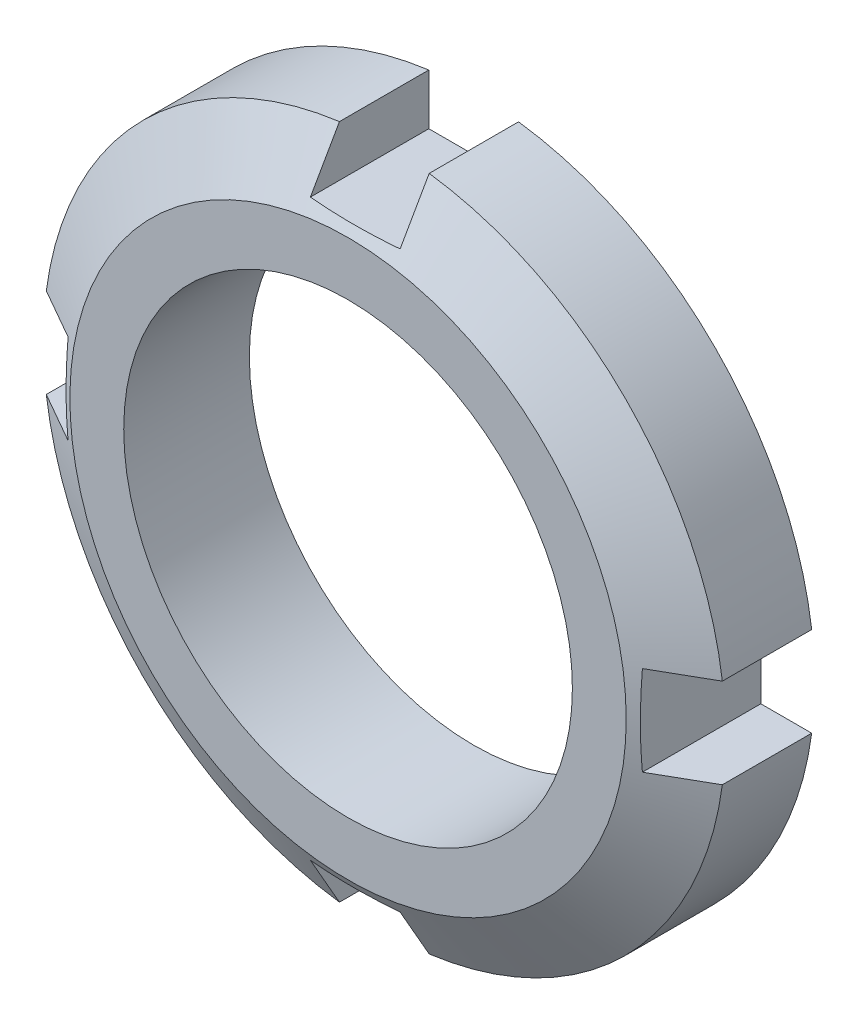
ISO-10303-21;
HEADER;
FILE_DESCRIPTION(('STEP AP214'),'2;1');
FILE_NAME('part.step','',(''),(''),'','','');
FILE_SCHEMA(('AUTOMOTIVE_DESIGN { 1 0 10303 214 1 1 1 1 }'));
ENDSEC;
DATA;
#1=APPLICATION_CONTEXT('core data for automotive mechanical design processes');
#2=APPLICATION_PROTOCOL_DEFINITION('international standard','automotive_design',2000,#1);
#3=PRODUCT_CONTEXT('',#1,'mechanical');
#4=PRODUCT('Part','Part','',(#3));
#5=PRODUCT_RELATED_PRODUCT_CATEGORY('part','',(#4));
#6=PRODUCT_DEFINITION_FORMATION('','',#4);
#7=PRODUCT_DEFINITION_CONTEXT('part definition',#1,'design');
#8=PRODUCT_DEFINITION('design','',#6,#7);
#9=PRODUCT_DEFINITION_SHAPE('','',#8);
#10=(LENGTH_UNIT() NAMED_UNIT(*) SI_UNIT(.MILLI.,.METRE.));
#11=(NAMED_UNIT(*) PLANE_ANGLE_UNIT() SI_UNIT($,.RADIAN.));
#12=(NAMED_UNIT(*) SI_UNIT($,.STERADIAN.) SOLID_ANGLE_UNIT());
#13=UNCERTAINTY_MEASURE_WITH_UNIT(LENGTH_MEASURE(1.E-05),#10,'distance_accuracy_value','');
#14=(GEOMETRIC_REPRESENTATION_CONTEXT(3) GLOBAL_UNCERTAINTY_ASSIGNED_CONTEXT((#13)) GLOBAL_UNIT_ASSIGNED_CONTEXT((#10,
#11,#12)) REPRESENTATION_CONTEXT('',''));
#15=CARTESIAN_POINT('',(0.,0.,0.));
#16=DIRECTION('',(0.,0.,1.));
#17=DIRECTION('',(1.,0.,0.));
#18=AXIS2_PLACEMENT_3D('',#15,#16,#17);
#19=CARTESIAN_POINT('',(0.,0.,7.));
#20=DIRECTION('',(0.,0.,-1.));
#21=DIRECTION('',(-1.,0.,0.));
#22=AXIS2_PLACEMENT_3D('',#19,#20,#21);
#23=CYLINDRICAL_SURFACE('',#22,19.);
#24=CARTESIAN_POINT('',(0.,0.,4.97927405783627));
#25=DIRECTION('',(0.,0.,1.));
#26=DIRECTION('',(1.,0.,0.));
#27=AXIS2_PLACEMENT_3D('',#24,#25,#26);
#28=CIRCLE('',#27,19.);
#29=CARTESIAN_POINT('',(2.5,18.8348082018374,4.97927405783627));
#30=VERTEX_POINT('',#29);
#31=CARTESIAN_POINT('',(18.8348082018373,2.5000000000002,4.97927405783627));
#32=VERTEX_POINT('',#31);
#33=EDGE_CURVE('E247',#30,#32,#28,.F.);
#34=ORIENTED_EDGE('',*,*,#33,.T.);
#35=DIRECTION('',(0.,0.,-1.));
#36=VECTOR('',#35,1.);
#37=CARTESIAN_POINT('',(18.8348082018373,2.50000000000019,7.));
#38=LINE('',#37,#36);
#39=CARTESIAN_POINT('',(18.8348082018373,2.5000000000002,0.));
#40=VERTEX_POINT('',#39);
#41=EDGE_CURVE('E176',#32,#40,#38,.T.);
#42=ORIENTED_EDGE('',*,*,#41,.T.);
#43=CARTESIAN_POINT('',(0.,0.,0.));
#44=DIRECTION('',(0.,0.,1.));
#45=DIRECTION('',(1.,0.,0.));
#46=AXIS2_PLACEMENT_3D('',#43,#44,#45);
#47=CIRCLE('',#46,19.);
#48=CARTESIAN_POINT('',(2.5,18.8348082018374,0.));
#49=VERTEX_POINT('',#48);
#50=EDGE_CURVE('E168',#40,#49,#47,.T.);
#51=ORIENTED_EDGE('',*,*,#50,.T.);
#52=DIRECTION('',(0.,0.,-1.));
#53=VECTOR('',#52,1.);
#54=CARTESIAN_POINT('',(2.5,18.8348082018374,7.));
#55=LINE('',#54,#53);
#56=EDGE_CURVE('E226',#49,#30,#55,.F.);
#57=ORIENTED_EDGE('',*,*,#56,.T.);
#58=EDGE_LOOP('',(#34,#42,#51,#57));
#59=FACE_BOUND('',#58,.T.);
#60=ADVANCED_FACE('F32',(#59),#23,.T.);
#61=CARTESIAN_POINT('',(2.50000000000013,-18.8348082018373,0.));
#62=VERTEX_POINT('',#61);
#63=CARTESIAN_POINT('',(18.8348082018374,-2.49999999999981,0.));
#64=VERTEX_POINT('',#63);
#65=EDGE_CURVE('E405',#62,#64,#47,.T.);
#66=ORIENTED_EDGE('',*,*,#65,.T.);
#67=DIRECTION('',(0.,0.,-1.));
#68=VECTOR('',#67,1.);
#69=CARTESIAN_POINT('',(18.8348082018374,-2.49999999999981,7.));
#70=LINE('',#69,#68);
#71=CARTESIAN_POINT('',(18.8348082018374,-2.49999999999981,4.97927405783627));
#72=VERTEX_POINT('',#71);
#73=EDGE_CURVE('E172',#64,#72,#70,.F.);
#74=ORIENTED_EDGE('',*,*,#73,.T.);
#75=CARTESIAN_POINT('',(2.50000000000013,-18.8348082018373,4.97927405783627));
#76=VERTEX_POINT('',#75);
#77=EDGE_CURVE('E251',#72,#76,#28,.F.);
#78=ORIENTED_EDGE('',*,*,#77,.T.);
#79=DIRECTION('',(0.,0.,-1.));
#80=VECTOR('',#79,1.);
#81=CARTESIAN_POINT('',(2.50000000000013,-18.8348082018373,7.));
#82=LINE('',#81,#80);
#83=EDGE_CURVE('E193',#76,#62,#82,.T.);
#84=ORIENTED_EDGE('',*,*,#83,.T.);
#85=EDGE_LOOP('',(#66,#74,#78,#84));
#86=FACE_BOUND('',#85,.T.);
#87=ADVANCED_FACE('F362',(#86),#23,.T.);
#88=CARTESIAN_POINT('',(-18.8348082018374,-2.50000000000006,0.));
#89=VERTEX_POINT('',#88);
#90=CARTESIAN_POINT('',(-2.49999999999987,-18.8348082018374,0.));
#91=VERTEX_POINT('',#90);
#92=EDGE_CURVE('E243',#89,#91,#47,.T.);
#93=ORIENTED_EDGE('',*,*,#92,.T.);
#94=DIRECTION('',(0.,0.,-1.));
#95=VECTOR('',#94,1.);
#96=CARTESIAN_POINT('',(-2.49999999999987,-18.8348082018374,7.));
#97=LINE('',#96,#95);
#98=CARTESIAN_POINT('',(-2.49999999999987,-18.8348082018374,4.97927405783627));
#99=VERTEX_POINT('',#98);
#100=EDGE_CURVE('E189',#91,#99,#97,.F.);
#101=ORIENTED_EDGE('',*,*,#100,.T.);
#102=CARTESIAN_POINT('',(-18.8348082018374,-2.50000000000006,4.97927405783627));
#103=VERTEX_POINT('',#102);
#104=EDGE_CURVE('E390',#99,#103,#28,.F.);
#105=ORIENTED_EDGE('',*,*,#104,.T.);
#106=DIRECTION('',(0.,0.,-1.));
#107=VECTOR('',#106,1.);
#108=CARTESIAN_POINT('',(-18.8348082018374,-2.50000000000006,7.));
#109=LINE('',#108,#107);
#110=EDGE_CURVE('E212',#103,#89,#109,.T.);
#111=ORIENTED_EDGE('',*,*,#110,.T.);
#112=EDGE_LOOP('',(#93,#101,#105,#111));
#113=FACE_BOUND('',#112,.T.);
#114=ADVANCED_FACE('F367',(#113),#23,.T.);
#115=CARTESIAN_POINT('',(-2.5,18.8348082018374,0.));
#116=VERTEX_POINT('',#115);
#117=CARTESIAN_POINT('',(-18.8348082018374,2.49999999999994,0.));
#118=VERTEX_POINT('',#117);
#119=EDGE_CURVE('E239',#116,#118,#47,.T.);
#120=ORIENTED_EDGE('',*,*,#119,.T.);
#121=DIRECTION('',(0.,0.,-1.));
#122=VECTOR('',#121,1.);
#123=CARTESIAN_POINT('',(-18.8348082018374,2.49999999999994,7.));
#124=LINE('',#123,#122);
#125=CARTESIAN_POINT('',(-18.8348082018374,2.49999999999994,4.97927405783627));
#126=VERTEX_POINT('',#125);
#127=EDGE_CURVE('E208',#118,#126,#124,.F.);
#128=ORIENTED_EDGE('',*,*,#127,.T.);
#129=CARTESIAN_POINT('',(-2.5,18.8348082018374,4.97927405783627));
#130=VERTEX_POINT('',#129);
#131=EDGE_CURVE('E246',#126,#130,#28,.F.);
#132=ORIENTED_EDGE('',*,*,#131,.T.);
#133=DIRECTION('',(0.,0.,-1.));
#134=VECTOR('',#133,1.);
#135=CARTESIAN_POINT('',(-2.5,18.8348082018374,7.));
#136=LINE('',#135,#134);
#137=EDGE_CURVE('E230',#130,#116,#136,.T.);
#138=ORIENTED_EDGE('',*,*,#137,.T.);
#139=EDGE_LOOP('',(#120,#128,#132,#138));
#140=FACE_BOUND('',#139,.T.);
#141=ADVANCED_FACE('F34',(#140),#23,.T.);
#142=CARTESIAN_POINT('',(0.,0.,7.));
#143=DIRECTION('',(0.,0.,1.));
#144=DIRECTION('',(1.,0.,0.));
#145=AXIS2_PLACEMENT_3D('',#142,#143,#144);
#146=PLANE('',#145);
#147=CARTESIAN_POINT('',(0.,0.,7.));
#148=DIRECTION('',(0.,0.,1.));
#149=DIRECTION('',(1.,0.,0.));
#150=AXIS2_PLACEMENT_3D('',#147,#148,#149);
#151=CIRCLE('',#150,15.5);
#152=CARTESIAN_POINT('',(15.5,0.,7.));
#153=VERTEX_POINT('',#152);
#154=EDGE_CURVE('E242',#153,#153,#151,.T.);
#155=ORIENTED_EDGE('',*,*,#154,.T.);
#156=EDGE_LOOP('',(#155));
#157=FACE_BOUND('',#156,.T.);
#158=CARTESIAN_POINT('',(0.,0.,7.));
#159=DIRECTION('',(0.,0.,1.));
#160=DIRECTION('',(1.,0.,0.));
#161=AXIS2_PLACEMENT_3D('',#158,#159,#160);
#162=CIRCLE('',#161,12.5);
#163=CARTESIAN_POINT('',(12.5,0.,7.));
#164=VERTEX_POINT('',#163);
#165=EDGE_CURVE('E233',#164,#164,#162,.T.);
#166=ORIENTED_EDGE('',*,*,#165,.F.);
#167=EDGE_LOOP('',(#166));
#168=FACE_BOUND('',#167,.T.);
#169=ADVANCED_FACE('F370',(#157,#168),#146,.T.);
#170=CARTESIAN_POINT('',(0.,0.,0.));
#171=DIRECTION('',(0.,0.,1.));
#172=DIRECTION('',(1.,0.,0.));
#173=AXIS2_PLACEMENT_3D('',#170,#171,#172);
#174=PLANE('',#173);
#175=ORIENTED_EDGE('',*,*,#50,.F.);
#176=DIRECTION('',(-1.,0.,0.));
#177=VECTOR('',#176,1.);
#178=CARTESIAN_POINT('',(19.,2.5000000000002,0.));
#179=LINE('',#178,#177);
#180=CARTESIAN_POINT('',(16.,2.50000000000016,0.));
#181=VERTEX_POINT('',#180);
#182=EDGE_CURVE('E156',#40,#181,#179,.T.);
#183=ORIENTED_EDGE('',*,*,#182,.T.);
#184=DIRECTION('',(0.,1.,0.));
#185=VECTOR('',#184,1.);
#186=CARTESIAN_POINT('',(16.,-2.49999999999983,0.));
#187=LINE('',#186,#185);
#188=CARTESIAN_POINT('',(16.,-2.49999999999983,0.));
#189=VERTEX_POINT('',#188);
#190=EDGE_CURVE('E147',#189,#181,#187,.T.);
#191=ORIENTED_EDGE('',*,*,#190,.F.);
#192=DIRECTION('',(1.,0.,0.));
#193=VECTOR('',#192,1.);
#194=CARTESIAN_POINT('',(16.,-2.49999999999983,0.));
#195=LINE('',#194,#193);
#196=EDGE_CURVE('E155',#189,#64,#195,.T.);
#197=ORIENTED_EDGE('',*,*,#196,.T.);
#198=ORIENTED_EDGE('',*,*,#65,.F.);
#199=DIRECTION('',(0.,1.,0.));
#200=VECTOR('',#199,1.);
#201=CARTESIAN_POINT('',(2.50000000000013,-19.,0.));
#202=LINE('',#201,#200);
#203=CARTESIAN_POINT('',(2.50000000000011,-16.,0.));
#204=VERTEX_POINT('',#203);
#205=EDGE_CURVE('E178',#62,#204,#202,.T.);
#206=ORIENTED_EDGE('',*,*,#205,.T.);
#207=DIRECTION('',(1.,0.,0.));
#208=VECTOR('',#207,1.);
#209=CARTESIAN_POINT('',(-2.49999999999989,-16.,0.));
#210=LINE('',#209,#208);
#211=CARTESIAN_POINT('',(-2.49999999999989,-16.,0.));
#212=VERTEX_POINT('',#211);
#213=EDGE_CURVE('E181',#212,#204,#210,.T.);
#214=ORIENTED_EDGE('',*,*,#213,.F.);
#215=DIRECTION('',(0.,-1.,0.));
#216=VECTOR('',#215,1.);
#217=CARTESIAN_POINT('',(-2.49999999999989,-16.,0.));
#218=LINE('',#217,#216);
#219=EDGE_CURVE('E183',#212,#91,#218,.T.);
#220=ORIENTED_EDGE('',*,*,#219,.T.);
#221=ORIENTED_EDGE('',*,*,#92,.F.);
#222=DIRECTION('',(1.,0.,0.));
#223=VECTOR('',#222,1.);
#224=CARTESIAN_POINT('',(-19.,-2.50000000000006,0.));
#225=LINE('',#224,#223);
#226=CARTESIAN_POINT('',(-16.,-2.50000000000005,0.));
#227=VERTEX_POINT('',#226);
#228=EDGE_CURVE('E196',#89,#227,#225,.T.);
#229=ORIENTED_EDGE('',*,*,#228,.T.);
#230=DIRECTION('',(0.,-1.,0.));
#231=VECTOR('',#230,1.);
#232=CARTESIAN_POINT('',(-16.,2.49999999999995,0.));
#233=LINE('',#232,#231);
#234=CARTESIAN_POINT('',(-16.,2.49999999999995,0.));
#235=VERTEX_POINT('',#234);
#236=EDGE_CURVE('E199',#235,#227,#233,.T.);
#237=ORIENTED_EDGE('',*,*,#236,.F.);
#238=DIRECTION('',(-1.,0.,0.));
#239=VECTOR('',#238,1.);
#240=CARTESIAN_POINT('',(-16.,2.49999999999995,0.));
#241=LINE('',#240,#239);
#242=EDGE_CURVE('E201',#235,#118,#241,.T.);
#243=ORIENTED_EDGE('',*,*,#242,.T.);
#244=ORIENTED_EDGE('',*,*,#119,.F.);
#245=DIRECTION('',(0.,-1.,0.));
#246=VECTOR('',#245,1.);
#247=CARTESIAN_POINT('',(-2.5,19.,0.));
#248=LINE('',#247,#246);
#249=CARTESIAN_POINT('',(-2.5,16.,0.));
#250=VERTEX_POINT('',#249);
#251=EDGE_CURVE('E215',#116,#250,#248,.T.);
#252=ORIENTED_EDGE('',*,*,#251,.T.);
#253=DIRECTION('',(-1.,0.,0.));
#254=VECTOR('',#253,1.);
#255=CARTESIAN_POINT('',(2.5,16.,0.));
#256=LINE('',#255,#254);
#257=CARTESIAN_POINT('',(2.5,16.,0.));
#258=VERTEX_POINT('',#257);
#259=EDGE_CURVE('E218',#258,#250,#256,.T.);
#260=ORIENTED_EDGE('',*,*,#259,.F.);
#261=DIRECTION('',(0.,1.,0.));
#262=VECTOR('',#261,1.);
#263=CARTESIAN_POINT('',(2.5,16.,0.));
#264=LINE('',#263,#262);
#265=EDGE_CURVE('E220',#258,#49,#264,.T.);
#266=ORIENTED_EDGE('',*,*,#265,.T.);
#267=EDGE_LOOP('',(#175,#183,#191,#197,#198,#206,#214,#220,#221,#229,#237,#243,#244,#252,#260,#266));
#268=FACE_BOUND('',#267,.T.);
#269=CARTESIAN_POINT('',(0.,0.,0.));
#270=DIRECTION('',(0.,0.,1.));
#271=DIRECTION('',(1.,0.,0.));
#272=AXIS2_PLACEMENT_3D('',#269,#270,#271);
#273=CIRCLE('',#272,12.5);
#274=CARTESIAN_POINT('',(12.5,0.,0.));
#275=VERTEX_POINT('',#274);
#276=EDGE_CURVE('E236',#275,#275,#273,.T.);
#277=ORIENTED_EDGE('',*,*,#276,.T.);
#278=EDGE_LOOP('',(#277));
#279=FACE_BOUND('',#278,.T.);
#280=ADVANCED_FACE('F165',(#268,#279),#174,.F.);
#281=CARTESIAN_POINT('',(0.,0.,0.));
#282=DIRECTION('',(0.,0.,1.));
#283=DIRECTION('',(1.,0.,0.));
#284=AXIS2_PLACEMENT_3D('',#281,#282,#283);
#285=CYLINDRICAL_SURFACE('',#284,12.5);
#286=ORIENTED_EDGE('',*,*,#276,.F.);
#287=EDGE_LOOP('',(#286));
#288=FACE_BOUND('',#287,.T.);
#289=ORIENTED_EDGE('',*,*,#165,.T.);
#290=EDGE_LOOP('',(#289));
#291=FACE_BOUND('',#290,.T.);
#292=ADVANCED_FACE('F505',(#288,#291),#285,.F.);
#293=CARTESIAN_POINT('',(0.,0.,7.));
#294=DIRECTION('',(0.,0.,-1.));
#295=DIRECTION('',(-1.,0.,0.));
#296=AXIS2_PLACEMENT_3D('',#293,#294,#295);
#297=CONICAL_SURFACE('',#296,15.5,1.04719755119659);
#298=CARTESIAN_POINT('',(23.3838289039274,2.50000000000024,2.37133176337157));
#299=CARTESIAN_POINT('',(22.8794651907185,2.50000000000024,2.66087538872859));
#300=CARTESIAN_POINT('',(22.3750567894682,2.50000000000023,2.95034113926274));
#301=CARTESIAN_POINT('',(21.3661278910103,2.50000000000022,3.52907746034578));
#302=CARTESIAN_POINT('',(20.861607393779,2.50000000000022,3.81834803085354));
#303=CARTESIAN_POINT('',(19.3478472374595,2.5000000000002,4.68580578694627));
#304=CARTESIAN_POINT('',(18.3384056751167,2.50000000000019,5.26364087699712));
#305=CARTESIAN_POINT('',(16.8235900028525,2.50000000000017,6.12925402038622));
#306=CARTESIAN_POINT('',(16.3185417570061,2.50000000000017,6.41760227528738));
#307=CARTESIAN_POINT('',(15.3081565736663,2.50000000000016,6.99379212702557));
#308=CARTESIAN_POINT('',(14.8028196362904,2.50000000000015,7.28163372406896));
#309=CARTESIAN_POINT('',(13.7917632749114,2.50000000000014,7.85664853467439));
#310=CARTESIAN_POINT('',(13.2860438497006,2.50000000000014,8.14382174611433));
#311=CARTESIAN_POINT('',(12.2740588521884,2.50000000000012,8.71720570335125));
#312=CARTESIAN_POINT('',(11.7677932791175,2.50000000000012,9.00341644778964));
#313=CARTESIAN_POINT('',(11.2611727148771,2.50000000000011,9.28899896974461));
#314=B_SPLINE_CURVE_WITH_KNOTS('',3,(#298,#299,#300,#301,#302,#303,#304,#305,#306,#307,#308,
#309,#310,#311,#312,#313),.UNSPECIFIED.,.F.,.F.,(4,2,2,2,2,2,2,4),(0.,1.74469602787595,
3.489392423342,6.97877401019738,8.72347032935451,10.4681659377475,12.2128670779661,
13.9575706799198),.UNSPECIFIED.);
#315=CARTESIAN_POINT('',(16.,2.50000000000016,6.59924112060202));
#316=VERTEX_POINT('',#315);
#317=EDGE_CURVE('E11',#32,#316,#314,.T.);
#318=ORIENTED_EDGE('',*,*,#317,.F.);
#319=ORIENTED_EDGE('',*,*,#33,.F.);
#320=CARTESIAN_POINT('',(2.5,11.2611727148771,9.28899896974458));
#321=CARTESIAN_POINT('',(2.5,11.7677932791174,9.00341644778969));
#322=CARTESIAN_POINT('',(2.5,12.2740588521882,8.71720570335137));
#323=CARTESIAN_POINT('',(2.5,13.2860438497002,8.14382174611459));
#324=CARTESIAN_POINT('',(2.5,13.7917632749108,7.85664853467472));
#325=CARTESIAN_POINT('',(2.5,14.8028196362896,7.28163372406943));
#326=CARTESIAN_POINT('',(2.5,15.3081565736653,6.99379212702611));
#327=CARTESIAN_POINT('',(2.5,16.318541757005,6.41760227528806));
#328=CARTESIAN_POINT('',(2.5,16.8235900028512,6.12925402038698));
#329=CARTESIAN_POINT('',(2.5,18.3384056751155,5.26364087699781));
#330=CARTESIAN_POINT('',(2.5,19.3478472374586,4.68580578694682));
#331=CARTESIAN_POINT('',(2.5,20.8616073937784,3.81834803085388));
#332=CARTESIAN_POINT('',(2.5,21.3661278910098,3.52907746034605));
#333=CARTESIAN_POINT('',(2.5,22.375056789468,2.95034113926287));
#334=CARTESIAN_POINT('',(2.5,22.8794651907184,2.66087538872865));
#335=CARTESIAN_POINT('',(2.5,23.3838289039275,2.37133176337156));
#336=B_SPLINE_CURVE_WITH_KNOTS('',3,(#320,#321,#322,#323,#324,#325,#326,#327,#328,#329,#330,
#331,#332,#333,#334,#335),.UNSPECIFIED.,.F.,.F.,(4,2,2,2,2,2,2,4),(0.,1.74470360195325,
3.48940474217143,5.23410035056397,6.97879666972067,10.4681782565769,12.2128746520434,
13.9575706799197),.UNSPECIFIED.);
#337=CARTESIAN_POINT('',(2.5,16.,6.59924112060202));
#338=VERTEX_POINT('',#337);
#339=EDGE_CURVE('E258',#338,#30,#336,.T.);
#340=ORIENTED_EDGE('',*,*,#339,.F.);
#341=CARTESIAN_POINT('',(6.81810215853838,16.,5.90757273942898));
#342=CARTESIAN_POINT('',(6.45840968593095,16.,5.98899370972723));
#343=CARTESIAN_POINT('',(6.09750734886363,16.,6.06521717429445));
#344=CARTESIAN_POINT('',(5.37340801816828,16.,6.20628219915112));
#345=CARTESIAN_POINT('',(5.01021053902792,16.,6.27112126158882));
#346=CARTESIAN_POINT('',(4.28143097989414,16.,6.38845405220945));
#347=CARTESIAN_POINT('',(3.91584683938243,16.,6.44093507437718));
#348=CARTESIAN_POINT('',(3.18302879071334,16.,6.5325647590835));
#349=CARTESIAN_POINT('',(2.81579499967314,16.,6.57171435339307));
#350=CARTESIAN_POINT('',(2.08770543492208,16.,6.63528829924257));
#351=CARTESIAN_POINT('',(1.72687492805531,16.,6.66000059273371));
#352=CARTESIAN_POINT('',(1.00452181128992,16.,6.6954691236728));
#353=CARTESIAN_POINT('',(0.642999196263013,16.,6.70622525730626));
#354=CARTESIAN_POINT('',(-0.0799248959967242,16.,6.71356453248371));
#355=CARTESIAN_POINT('',(-0.441326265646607,16.,6.71015813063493));
#356=CARTESIAN_POINT('',(-1.16372288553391,16.,6.68926620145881));
#357=CARTESIAN_POINT('',(-1.52471812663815,16.,6.67178036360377));
#358=CARTESIAN_POINT('',(-2.33620167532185,16.,6.61695222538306));
#359=CARTESIAN_POINT('',(-2.78643105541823,16.,6.57573016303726));
#360=CARTESIAN_POINT('',(-3.6845648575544,16.,6.47295677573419));
#361=CARTESIAN_POINT('',(-4.13246912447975,16.,6.4114041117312));
#362=CARTESIAN_POINT('',(-5.02595060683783,16.,6.2694769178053));
#363=CARTESIAN_POINT('',(-5.47152334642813,16.,6.18907440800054));
#364=CARTESIAN_POINT('',(-6.35928544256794,16.,6.01133878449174));
#365=CARTESIAN_POINT('',(-6.80147457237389,16.,5.9140045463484));
#366=CARTESIAN_POINT('',(-7.69434638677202,16.,5.70144186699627));
#367=CARTESIAN_POINT('',(-8.14492904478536,16.,5.58579558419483));
#368=CARTESIAN_POINT('',(-9.04232668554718,16.,5.34063966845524));
#369=CARTESIAN_POINT('',(-9.48914135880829,16.,5.21112890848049));
#370=CARTESIAN_POINT('',(-10.3774651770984,16.,4.94060292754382));
#371=CARTESIAN_POINT('',(-10.8189877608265,16.,4.79963158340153));
#372=CARTESIAN_POINT('',(-11.6984784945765,16.,4.50740055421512));
#373=CARTESIAN_POINT('',(-12.136447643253,16.,4.35614388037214));
#374=CARTESIAN_POINT('',(-12.57281585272,16.,4.2005151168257));
#375=B_SPLINE_CURVE_WITH_KNOTS('',3,(#341,#342,#343,#344,#345,#346,#347,#348,#349,#350,#351,
#352,#353,#354,#355,#356,#357,#358,#359,#360,#361,#362,#363,#364,#365,#366,#367,#368,#369,#370,
#371,#372,#373,#374),.UNSPECIFIED.,.F.,.F.,(4,2,2,2,2,2,2,2,2,2,2,2,2,2,2,2,4),(0.,
1.10638798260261,2.21301841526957,3.32078171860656,4.42846758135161,5.51323240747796,
6.59800530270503,7.68197742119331,8.76597344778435,10.121799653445,11.4777151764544,
12.8356562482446,14.1936875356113,15.588995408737,16.9844167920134,18.3747269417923,
19.7646317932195),.UNSPECIFIED.);
#376=CARTESIAN_POINT('',(-2.5,16.,6.59924112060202));
#377=VERTEX_POINT('',#376);
#378=EDGE_CURVE('E250',#338,#377,#375,.T.);
#379=ORIENTED_EDGE('',*,*,#378,.T.);
#380=CARTESIAN_POINT('',(-2.5,23.3838289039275,2.37133176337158));
#381=CARTESIAN_POINT('',(-2.5,22.8794651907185,2.6608753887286));
#382=CARTESIAN_POINT('',(-2.5,22.3750567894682,2.95034113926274));
#383=CARTESIAN_POINT('',(-2.5,21.3661278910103,3.52907746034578));
#384=CARTESIAN_POINT('',(-2.5,20.861607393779,3.81834803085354));
#385=CARTESIAN_POINT('',(-2.5,19.3478472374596,4.68580578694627));
#386=CARTESIAN_POINT('',(-2.5,18.3384056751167,5.26364087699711));
#387=CARTESIAN_POINT('',(-2.5,16.8235900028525,6.12925402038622));
#388=CARTESIAN_POINT('',(-2.5,16.3185417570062,6.41760227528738));
#389=CARTESIAN_POINT('',(-2.5,15.3081565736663,6.99379212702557));
#390=CARTESIAN_POINT('',(-2.5,14.8028196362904,7.28163372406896));
#391=CARTESIAN_POINT('',(-2.5,13.7917632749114,7.85664853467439));
#392=CARTESIAN_POINT('',(-2.5,13.2860438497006,8.14382174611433));
#393=CARTESIAN_POINT('',(-2.5,12.2740588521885,8.71720570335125));
#394=CARTESIAN_POINT('',(-2.5,11.7677932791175,9.00341644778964));
#395=CARTESIAN_POINT('',(-2.5,11.2611727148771,9.2889989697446));
#396=B_SPLINE_CURVE_WITH_KNOTS('',3,(#380,#381,#382,#383,#384,#385,#386,#387,#388,#389,#390,
#391,#392,#393,#394,#395),.UNSPECIFIED.,.F.,.F.,(4,2,2,2,2,2,2,4),(0.,1.74469602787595,
3.489392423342,6.97877401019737,8.7234703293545,10.4681659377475,12.2128670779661,
13.9575706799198),.UNSPECIFIED.);
#397=EDGE_CURVE('E280',#130,#377,#396,.T.);
#398=ORIENTED_EDGE('',*,*,#397,.F.);
#399=ORIENTED_EDGE('',*,*,#131,.F.);
#400=CARTESIAN_POINT('',(-12.3950159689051,2.49999999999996,8.64855427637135));
#401=CARTESIAN_POINT('',(-12.901136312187,2.49999999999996,8.3620894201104));
#402=CARTESIAN_POINT('',(-13.406983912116,2.49999999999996,8.07514354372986));
#403=CARTESIAN_POINT('',(-14.4182530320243,2.49999999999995,7.50050282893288));
#404=CARTESIAN_POINT('',(-14.9236745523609,2.49999999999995,7.21280799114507));
#405=CARTESIAN_POINT('',(-15.9342107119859,2.49999999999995,6.63688255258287));
#406=CARTESIAN_POINT('',(-16.4393253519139,2.49999999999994,6.34865195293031));
#407=CARTESIAN_POINT('',(-17.4493183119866,2.49999999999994,5.77177675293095));
#408=CARTESIAN_POINT('',(-17.954196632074,2.49999999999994,5.48313215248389));
#409=CARTESIAN_POINT('',(-19.468560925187,2.49999999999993,4.6167300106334));
#410=CARTESIAN_POINT('',(-20.4777782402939,2.49999999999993,4.03850298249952));
#411=CARTESIAN_POINT('',(-22.4957358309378,2.49999999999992,2.88121217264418));
#412=CARTESIAN_POINT('',(-23.5044761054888,2.49999999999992,2.30214838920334));
#413=CARTESIAN_POINT('',(-24.5130954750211,2.49999999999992,1.72287502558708));
#414=B_SPLINE_CURVE_WITH_KNOTS('',3,(#400,#401,#402,#403,#404,#405,#406,#407,#408,#409,#410,
#411,#412,#413),.UNSPECIFIED.,.F.,.F.,(4,2,2,2,2,2,4),(0.,1.74469946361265,3.48939746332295,
5.23409181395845,6.97878658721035,10.4681691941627,13.9575589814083),.UNSPECIFIED.);
#415=CARTESIAN_POINT('',(-16.,2.49999999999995,6.59924112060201));
#416=VERTEX_POINT('',#415);
#417=EDGE_CURVE('E293',#416,#126,#414,.T.);
#418=ORIENTED_EDGE('',*,*,#417,.F.);
#419=CARTESIAN_POINT('',(-16.,6.81810272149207,5.90757261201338));
#420=CARTESIAN_POINT('',(-16.,6.45841023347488,5.98899359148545));
#421=CARTESIAN_POINT('',(-16.,6.09750788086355,6.06521706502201));
#422=CARTESIAN_POINT('',(-16.,5.37340851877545,6.20628210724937));
#423=CARTESIAN_POINT('',(-16.,5.01021102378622,6.27112117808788));
#424=CARTESIAN_POINT('',(-16.,4.28143143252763,6.38845398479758));
#425=CARTESIAN_POINT('',(-16.,3.91584727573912,6.4409350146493));
#426=CARTESIAN_POINT('',(-16.,3.18302919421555,6.53256471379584));
#427=CARTESIAN_POINT('',(-16.,2.81579538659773,6.57171431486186));
#428=CARTESIAN_POINT('',(-16.,2.08770578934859,6.63528827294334));
#429=CARTESIAN_POINT('',(-16.,1.72687526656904,6.66000057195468));
#430=CARTESIAN_POINT('',(-16.,1.00452211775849,6.695469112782));
#431=CARTESIAN_POINT('',(-16.,0.642999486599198,6.70622525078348));
#432=CARTESIAN_POINT('',(-16.,-0.0799246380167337,6.71356453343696));
#433=CARTESIAN_POINT('',(-16.,-0.441326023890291,6.7101581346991));
#434=CARTESIAN_POINT('',(-16.,-1.1637226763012,6.68926621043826));
#435=CARTESIAN_POINT('',(-16.,-1.52471793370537,6.67178037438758));
#436=CARTESIAN_POINT('',(-16.,-2.33620150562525,6.61695223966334));
#437=CARTESIAN_POINT('',(-16.,-2.7864308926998,6.57573017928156));
#438=CARTESIAN_POINT('',(-16.,-3.68456470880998,6.47295679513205));
#439=CARTESIAN_POINT('',(-16.,-4.1324689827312,6.41140413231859));
#440=CARTESIAN_POINT('',(-16.,-5.02595047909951,6.26947694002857));
#441=CARTESIAN_POINT('',(-16.,-5.47152322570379,6.18907443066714));
#442=CARTESIAN_POINT('',(-16.,-6.35928533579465,6.0113388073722));
#443=CARTESIAN_POINT('',(-16.,-6.80147447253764,5.91400456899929));
#444=CARTESIAN_POINT('',(-16.,-7.69434630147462,5.70144188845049));
#445=CARTESIAN_POINT('',(-16.,-8.14492896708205,5.58579560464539));
#446=CARTESIAN_POINT('',(-16.,-9.04232662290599,5.34063968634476));
#447=CARTESIAN_POINT('',(-16.,-9.48914130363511,5.21112892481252));
#448=CARTESIAN_POINT('',(-16.,-10.3774651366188,4.94060294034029));
#449=CARTESIAN_POINT('',(-16.,-10.8189877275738,4.79963159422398));
#450=CARTESIAN_POINT('',(-16.,-11.6984784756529,4.5074005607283));
#451=CARTESIAN_POINT('',(-16.,-12.1364476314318,4.35614388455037));
#452=CARTESIAN_POINT('',(-16.,-12.5728158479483,4.2005151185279));
#453=B_SPLINE_CURVE_WITH_KNOTS('',3,(#419,#420,#421,#422,#423,#424,#425,#426,#427,#428,#429,
#430,#431,#432,#433,#434,#435,#436,#437,#438,#439,#440,#441,#442,#443,#444,#445,#446,#447,#448,
#449,#450,#451,#452),.UNSPECIFIED.,.F.,.F.,(4,2,2,2,2,2,2,2,2,2,2,2,2,2,2,2,4),(0.,
1.10638803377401,2.21301851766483,3.32078187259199,4.42846778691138,5.51323266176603,
6.59800560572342,7.68197777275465,8.76597384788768,10.1218000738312,11.47771561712,
12.8356567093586,14.1936880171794,15.5889959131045,16.9844173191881,18.3747274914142,
19.7646323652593),.UNSPECIFIED.);
#454=CARTESIAN_POINT('',(-16.,-2.50000000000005,6.59924112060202));
#455=VERTEX_POINT('',#454);
#456=EDGE_CURVE('E286',#416,#455,#453,.T.);
#457=ORIENTED_EDGE('',*,*,#456,.T.);
#458=CARTESIAN_POINT('',(-24.5130954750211,-2.50000000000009,1.72287502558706));
#459=CARTESIAN_POINT('',(-23.5044761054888,-2.50000000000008,2.30214838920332));
#460=CARTESIAN_POINT('',(-22.4957358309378,-2.50000000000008,2.88121217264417));
#461=CARTESIAN_POINT('',(-20.4777782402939,-2.50000000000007,4.03850298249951));
#462=CARTESIAN_POINT('',(-19.468560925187,-2.50000000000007,4.61673001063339));
#463=CARTESIAN_POINT('',(-17.954196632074,-2.50000000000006,5.48313215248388));
#464=CARTESIAN_POINT('',(-17.4493183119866,-2.50000000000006,5.77177675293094));
#465=CARTESIAN_POINT('',(-16.4393253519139,-2.50000000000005,6.34865195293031));
#466=CARTESIAN_POINT('',(-15.9342107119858,-2.50000000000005,6.63688255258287));
#467=CARTESIAN_POINT('',(-14.9236745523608,-2.50000000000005,7.21280799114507));
#468=CARTESIAN_POINT('',(-14.4182530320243,-2.50000000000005,7.50050282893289));
#469=CARTESIAN_POINT('',(-13.4069839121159,-2.50000000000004,8.07514354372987));
#470=CARTESIAN_POINT('',(-12.901136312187,-2.50000000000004,8.36208942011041));
#471=CARTESIAN_POINT('',(-12.3950159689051,-2.50000000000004,8.64855427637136));
#472=B_SPLINE_CURVE_WITH_KNOTS('',3,(#458,#459,#460,#461,#462,#463,#464,#465,#466,#467,#468,
#469,#470,#471),.UNSPECIFIED.,.F.,.F.,(4,2,2,2,2,2,4),(0.,3.48938978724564,6.97877239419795,
8.72346716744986,10.4681615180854,12.2128595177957,13.9575589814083),.UNSPECIFIED.);
#473=EDGE_CURVE('E310',#103,#455,#472,.T.);
#474=ORIENTED_EDGE('',*,*,#473,.F.);
#475=ORIENTED_EDGE('',*,*,#104,.F.);
#476=CARTESIAN_POINT('',(-2.49999999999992,-12.3950159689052,8.64855427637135));
#477=CARTESIAN_POINT('',(-2.49999999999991,-12.9011363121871,8.3620894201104));
#478=CARTESIAN_POINT('',(-2.49999999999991,-13.406983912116,8.07514354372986));
#479=CARTESIAN_POINT('',(-2.4999999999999,-14.4182530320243,7.50050282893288));
#480=CARTESIAN_POINT('',(-2.4999999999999,-14.9236745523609,7.21280799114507));
#481=CARTESIAN_POINT('',(-2.49999999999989,-15.9342107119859,6.63688255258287));
#482=CARTESIAN_POINT('',(-2.49999999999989,-16.4393253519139,6.34865195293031));
#483=CARTESIAN_POINT('',(-2.49999999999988,-17.4493183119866,5.77177675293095));
#484=CARTESIAN_POINT('',(-2.49999999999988,-17.954196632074,5.48313215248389));
#485=CARTESIAN_POINT('',(-2.49999999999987,-19.468560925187,4.6167300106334));
#486=CARTESIAN_POINT('',(-2.49999999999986,-20.4777782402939,4.03850298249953));
#487=CARTESIAN_POINT('',(-2.49999999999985,-22.4957358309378,2.88121217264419));
#488=CARTESIAN_POINT('',(-2.49999999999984,-23.5044761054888,2.30214838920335));
#489=CARTESIAN_POINT('',(-2.49999999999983,-24.513095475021,1.72287502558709));
#490=B_SPLINE_CURVE_WITH_KNOTS('',3,(#476,#477,#478,#479,#480,#481,#482,#483,#484,#485,#486,
#487,#488,#489),.UNSPECIFIED.,.F.,.F.,(4,2,2,2,2,2,4),(0.,1.74469946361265,3.48939746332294,
5.23409181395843,6.97878658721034,10.4681691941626,13.9575589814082),.UNSPECIFIED.);
#491=CARTESIAN_POINT('',(-2.49999999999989,-16.,6.59924112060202));
#492=VERTEX_POINT('',#491);
#493=EDGE_CURVE('E323',#492,#99,#490,.T.);
#494=ORIENTED_EDGE('',*,*,#493,.F.);
#495=CARTESIAN_POINT('',(-12.5728158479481,-16.0000000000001,4.20051511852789));
#496=CARTESIAN_POINT('',(-12.1364476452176,-16.0000000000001,4.35614387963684));
#497=CARTESIAN_POINT('',(-11.6984785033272,-16.0000000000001,4.5074005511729));
#498=CARTESIAN_POINT('',(-10.8189877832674,-16.0000000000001,4.79963157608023));
#499=CARTESIAN_POINT('',(-10.3774652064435,-16.0000000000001,4.94060291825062));
#500=CARTESIAN_POINT('',(-9.4891414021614,-16.0000000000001,5.2111288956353));
#501=CARTESIAN_POINT('',(-9.04232673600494,-16.0000000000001,5.34063965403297));
#502=CARTESIAN_POINT('',(-8.14492910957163,-16.0000000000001,5.58579556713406));
#503=CARTESIAN_POINT('',(-7.69434645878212,-16.0000000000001,5.70144184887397));
#504=CARTESIAN_POINT('',(-6.80147465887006,-16.,5.9140045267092));
#505=CARTESIAN_POINT('',(-6.35928553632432,-16.,6.01133876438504));
#506=CARTESIAN_POINT('',(-5.47152345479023,-16.,6.18907438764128));
#507=CARTESIAN_POINT('',(-5.02595072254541,-16.,6.26947689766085));
#508=CARTESIAN_POINT('',(-4.13246925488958,-16.,6.41140409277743));
#509=CARTESIAN_POINT('',(-3.68456499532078,-16.,6.47295675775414));
#510=CARTESIAN_POINT('',(-2.78643120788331,-16.,6.57573014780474));
#511=CARTESIAN_POINT('',(-2.33620183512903,-16.,6.61695221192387));
#512=CARTESIAN_POINT('',(-1.52471826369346,-16.,6.67178035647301));
#513=CARTESIAN_POINT('',(-1.16372299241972,-16.,6.6892661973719));
#514=CARTESIAN_POINT('',(-0.441326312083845,-16.,6.71015813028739));
#515=CARTESIAN_POINT('',(-0.0799249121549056,-16.,6.71356453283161));
#516=CARTESIAN_POINT('',(0.642999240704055,-16.,6.70622525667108));
#517=CARTESIAN_POINT('',(1.00452188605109,-16.,6.69546912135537));
#518=CARTESIAN_POINT('',(1.72687506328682,-16.,6.66000058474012));
#519=CARTESIAN_POINT('',(2.08770560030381,-16.,6.63528828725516));
#520=CARTESIAN_POINT('',(2.81579522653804,-16.,6.57171433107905));
#521=CARTESIAN_POINT('',(3.18302904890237,-16.,6.5325647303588));
#522=CARTESIAN_POINT('',(3.91584715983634,-16.,6.44093503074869));
#523=CARTESIAN_POINT('',(4.28143133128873,-16.,6.38845400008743));
#524=CARTESIAN_POINT('',(5.0102109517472,-16.,6.27112119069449));
#525=CARTESIAN_POINT('',(5.37340846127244,-16.,6.20628211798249));
#526=CARTESIAN_POINT('',(6.09750785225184,-16.,6.06521707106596));
#527=CARTESIAN_POINT('',(6.45841021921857,-16.,5.98899359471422));
#528=CARTESIAN_POINT('',(6.81810272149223,-16.,5.90757261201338));
#529=B_SPLINE_CURVE_WITH_KNOTS('',3,(#495,#496,#497,#498,#499,#500,#501,#502,#503,#504,#505,
#506,#507,#508,#509,#510,#511,#512,#513,#514,#515,#516,#517,#518,#519,#520,#521,#522,#523,#524,
#525,#526,#527,#528),.UNSPECIFIED.,.F.,.F.,(4,2,2,2,2,2,2,2,2,2,2,2,2,2,2,2,4),(0.,
1.38990482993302,2.78021495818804,4.17563631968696,5.57094417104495,6.92897543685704,
8.28691648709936,9.64283198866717,10.9986581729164,12.0826542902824,13.1666264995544,
14.2513994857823,15.3361644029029,16.4438503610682,17.551613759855,18.658244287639,
19.7646323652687),.UNSPECIFIED.);
#530=CARTESIAN_POINT('',(2.50000000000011,-16.,6.59924112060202));
#531=VERTEX_POINT('',#530);
#532=EDGE_CURVE('E316',#492,#531,#529,.T.);
#533=ORIENTED_EDGE('',*,*,#532,.T.);
#534=CARTESIAN_POINT('',(2.50000000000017,-24.5130954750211,1.72287502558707));
#535=CARTESIAN_POINT('',(2.50000000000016,-23.5044761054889,2.30214838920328));
#536=CARTESIAN_POINT('',(2.50000000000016,-22.4957358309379,2.88121217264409));
#537=CARTESIAN_POINT('',(2.50000000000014,-20.4777782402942,4.03850298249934));
#538=CARTESIAN_POINT('',(2.50000000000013,-19.4685609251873,4.61673001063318));
#539=CARTESIAN_POINT('',(2.50000000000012,-17.9541966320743,5.48313215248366));
#540=CARTESIAN_POINT('',(2.50000000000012,-17.449318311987,5.77177675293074));
#541=CARTESIAN_POINT('',(2.50000000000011,-16.4393253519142,6.34865195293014));
#542=CARTESIAN_POINT('',(2.50000000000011,-15.9342107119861,6.63688255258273));
#543=CARTESIAN_POINT('',(2.5000000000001,-14.923674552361,7.21280799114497));
#544=CARTESIAN_POINT('',(2.5000000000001,-14.4182530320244,7.50050282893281));
#545=CARTESIAN_POINT('',(2.50000000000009,-13.406983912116,8.07514354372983));
#546=CARTESIAN_POINT('',(2.50000000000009,-12.901136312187,8.36208942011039));
#547=CARTESIAN_POINT('',(2.50000000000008,-12.3950159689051,8.64855427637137));
#548=B_SPLINE_CURVE_WITH_KNOTS('',3,(#534,#535,#536,#537,#538,#539,#540,#541,#542,#543,#544,
#545,#546,#547),.UNSPECIFIED.,.F.,.F.,(4,2,2,2,2,2,4),(0.,3.48938978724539,6.97877239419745,
8.72346716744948,10.4681615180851,12.2128595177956,13.9575589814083),.UNSPECIFIED.);
#549=EDGE_CURVE('E337',#76,#531,#548,.T.);
#550=ORIENTED_EDGE('',*,*,#549,.F.);
#551=ORIENTED_EDGE('',*,*,#77,.F.);
#552=CARTESIAN_POINT('',(11.2611727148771,-2.49999999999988,9.28899896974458));
#553=CARTESIAN_POINT('',(11.7677932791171,-2.49999999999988,9.0034164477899));
#554=CARTESIAN_POINT('',(12.2740588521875,-2.49999999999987,8.71720570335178));
#555=CARTESIAN_POINT('',(13.2860438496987,-2.49999999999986,8.14382174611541));
#556=CARTESIAN_POINT('',(13.791763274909,-2.49999999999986,7.85664853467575));
#557=CARTESIAN_POINT('',(14.8028196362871,-2.49999999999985,7.28163372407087));
#558=CARTESIAN_POINT('',(15.3081565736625,-2.49999999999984,6.99379212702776));
#559=CARTESIAN_POINT('',(16.3185417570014,-2.49999999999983,6.41760227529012));
#560=CARTESIAN_POINT('',(16.8235900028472,-2.49999999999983,6.12925402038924));
#561=CARTESIAN_POINT('',(18.3384056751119,-2.49999999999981,5.26364087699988));
#562=CARTESIAN_POINT('',(19.3478472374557,-2.4999999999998,4.68580578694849));
#563=CARTESIAN_POINT('',(20.8616073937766,-2.49999999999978,3.81834803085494));
#564=CARTESIAN_POINT('',(21.3661278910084,-2.49999999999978,3.52907746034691));
#565=CARTESIAN_POINT('',(22.3750567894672,-2.49999999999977,2.95034113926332));
#566=CARTESIAN_POINT('',(22.879465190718,-2.49999999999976,2.6608753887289));
#567=CARTESIAN_POINT('',(23.3838289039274,-2.49999999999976,2.37133176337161));
#568=B_SPLINE_CURVE_WITH_KNOTS('',3,(#552,#553,#554,#555,#556,#557,#558,#559,#560,#561,#562,
#563,#564,#565,#566,#567),.UNSPECIFIED.,.F.,.F.,(4,2,2,2,2,2,2,4),(0.,1.74470360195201,
3.48940474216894,5.23410035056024,6.9787966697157,10.4681782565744,12.2128746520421,
13.9575706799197),.UNSPECIFIED.);
#569=CARTESIAN_POINT('',(16.,-2.49999999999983,6.59924112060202));
#570=VERTEX_POINT('',#569);
#571=EDGE_CURVE('E45',#570,#72,#568,.T.);
#572=ORIENTED_EDGE('',*,*,#571,.F.);
#573=CARTESIAN_POINT('',(16.0000000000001,-12.5728158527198,4.2005151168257));
#574=CARTESIAN_POINT('',(16.0000000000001,-12.1364476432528,4.35614388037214));
#575=CARTESIAN_POINT('',(16.0000000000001,-11.6984784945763,4.50740055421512));
#576=CARTESIAN_POINT('',(16.0000000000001,-10.8189877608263,4.79963158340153));
#577=CARTESIAN_POINT('',(16.0000000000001,-10.3774651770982,4.94060292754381));
#578=CARTESIAN_POINT('',(16.0000000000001,-9.48914135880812,5.21112890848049));
#579=CARTESIAN_POINT('',(16.0000000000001,-9.04232668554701,5.34063966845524));
#580=CARTESIAN_POINT('',(16.0000000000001,-8.14492904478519,5.58579558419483));
#581=CARTESIAN_POINT('',(16.0000000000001,-7.69434638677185,5.70144186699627));
#582=CARTESIAN_POINT('',(16.0000000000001,-6.80147457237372,5.9140045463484));
#583=CARTESIAN_POINT('',(16.0000000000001,-6.35928544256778,6.01133878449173));
#584=CARTESIAN_POINT('',(16.0000000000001,-5.47152334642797,6.18907440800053));
#585=CARTESIAN_POINT('',(16.0000000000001,-5.02595060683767,6.26947691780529));
#586=CARTESIAN_POINT('',(16.,-4.13246912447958,6.4114041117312));
#587=CARTESIAN_POINT('',(16.,-3.68456485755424,6.47295677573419));
#588=CARTESIAN_POINT('',(16.,-2.78643105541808,6.57573016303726));
#589=CARTESIAN_POINT('',(16.,-2.33620167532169,6.61695222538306));
#590=CARTESIAN_POINT('',(16.,-1.52471812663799,6.67178036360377));
#591=CARTESIAN_POINT('',(16.,-1.16372288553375,6.68926620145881));
#592=CARTESIAN_POINT('',(16.,-0.441326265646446,6.71015813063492));
#593=CARTESIAN_POINT('',(16.,-0.0799248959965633,6.71356453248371));
#594=CARTESIAN_POINT('',(16.,0.642999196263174,6.70622525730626));
#595=CARTESIAN_POINT('',(16.,1.00452181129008,6.6954691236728));
#596=CARTESIAN_POINT('',(16.,1.72687492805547,6.66000059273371));
#597=CARTESIAN_POINT('',(16.,2.08770543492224,6.63528829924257));
#598=CARTESIAN_POINT('',(16.,2.8157949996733,6.57171435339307));
#599=CARTESIAN_POINT('',(16.,3.1830287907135,6.5325647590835));
#600=CARTESIAN_POINT('',(16.,3.91584683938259,6.44093507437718));
#601=CARTESIAN_POINT('',(16.,4.2814309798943,6.38845405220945));
#602=CARTESIAN_POINT('',(15.9999999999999,5.01021053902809,6.27112126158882));
#603=CARTESIAN_POINT('',(15.9999999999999,5.37340801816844,6.20628219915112));
#604=CARTESIAN_POINT('',(15.9999999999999,6.09750734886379,6.06521717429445));
#605=CARTESIAN_POINT('',(15.9999999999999,6.45840968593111,5.98899370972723));
#606=CARTESIAN_POINT('',(15.9999999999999,6.81810215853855,5.90757273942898));
#607=B_SPLINE_CURVE_WITH_KNOTS('',3,(#573,#574,#575,#576,#577,#578,#579,#580,#581,#582,#583,
#584,#585,#586,#587,#588,#589,#590,#591,#592,#593,#594,#595,#596,#597,#598,#599,#600,#601,#602,
#603,#604,#605,#606),.UNSPECIFIED.,.F.,.F.,(4,2,2,2,2,2,2,2,2,2,2,2,2,2,2,2,4),(0.,
1.38990485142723,2.7802150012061,4.17563638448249,5.57094425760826,6.92897554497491,
8.28691661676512,9.64283213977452,10.9986583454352,12.0826543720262,13.1666264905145,
14.2513993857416,15.3361642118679,16.443850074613,17.5516133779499,18.6582438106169,
19.7646317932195),.UNSPECIFIED.);
#608=EDGE_CURVE('E342',#570,#316,#607,.T.);
#609=ORIENTED_EDGE('',*,*,#608,.T.);
#610=EDGE_LOOP('',(#318,#319,#340,#379,#398,#399,#418,#457,#474,#475,#494,#533,#550,#551,#572,#609));
#611=FACE_BOUND('',#610,.T.);
#612=ORIENTED_EDGE('',*,*,#154,.F.);
#613=EDGE_LOOP('',(#612));
#614=FACE_BOUND('',#613,.T.);
#615=ADVANCED_FACE('F264',(#611,#614),#297,.T.);
#616=CARTESIAN_POINT('',(-2.5,19.,0.));
#617=DIRECTION('',(-1.,0.,0.));
#618=DIRECTION('',(0.,-1.,0.));
#619=AXIS2_PLACEMENT_3D('',#616,#617,#618);
#620=PLANE('',#619);
#621=ORIENTED_EDGE('',*,*,#397,.T.);
#622=DIRECTION('',(0.,0.,1.));
#623=VECTOR('',#622,1.);
#624=CARTESIAN_POINT('',(-2.5,16.,0.));
#625=LINE('',#624,#623);
#626=EDGE_CURVE('E222',#250,#377,#625,.T.);
#627=ORIENTED_EDGE('',*,*,#626,.F.);
#628=ORIENTED_EDGE('',*,*,#251,.F.);
#629=ORIENTED_EDGE('',*,*,#137,.F.);
#630=EDGE_LOOP('',(#621,#627,#628,#629));
#631=FACE_BOUND('',#630,.T.);
#632=ADVANCED_FACE('F276',(#631),#620,.F.);
#633=CARTESIAN_POINT('',(2.5,16.,0.));
#634=DIRECTION('',(1.,0.,0.));
#635=DIRECTION('',(0.,0.,-1.));
#636=AXIS2_PLACEMENT_3D('',#633,#634,#635);
#637=PLANE('',#636);
#638=ORIENTED_EDGE('',*,*,#265,.F.);
#639=DIRECTION('',(0.,0.,1.));
#640=VECTOR('',#639,1.);
#641=CARTESIAN_POINT('',(2.5,16.,0.));
#642=LINE('',#641,#640);
#643=EDGE_CURVE('E223',#258,#338,#642,.T.);
#644=ORIENTED_EDGE('',*,*,#643,.T.);
#645=ORIENTED_EDGE('',*,*,#339,.T.);
#646=ORIENTED_EDGE('',*,*,#56,.F.);
#647=EDGE_LOOP('',(#638,#644,#645,#646));
#648=FACE_BOUND('',#647,.T.);
#649=ADVANCED_FACE('F272',(#648),#637,.F.);
#650=CARTESIAN_POINT('',(2.5,16.,0.));
#651=DIRECTION('',(0.,1.,0.));
#652=DIRECTION('',(0.,0.,1.));
#653=AXIS2_PLACEMENT_3D('',#650,#651,#652);
#654=PLANE('',#653);
#655=ORIENTED_EDGE('',*,*,#643,.F.);
#656=ORIENTED_EDGE('',*,*,#259,.T.);
#657=ORIENTED_EDGE('',*,*,#626,.T.);
#658=ORIENTED_EDGE('',*,*,#378,.F.);
#659=EDGE_LOOP('',(#655,#656,#657,#658));
#660=FACE_BOUND('',#659,.T.);
#661=ADVANCED_FACE('F268',(#660),#654,.T.);
#662=CARTESIAN_POINT('',(-19.,-2.50000000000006,0.));
#663=DIRECTION('',(0.,-1.,0.));
#664=DIRECTION('',(1.,0.,0.));
#665=AXIS2_PLACEMENT_3D('',#662,#663,#664);
#666=PLANE('',#665);
#667=ORIENTED_EDGE('',*,*,#473,.T.);
#668=DIRECTION('',(0.,0.,1.));
#669=VECTOR('',#668,1.);
#670=CARTESIAN_POINT('',(-16.,-2.50000000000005,0.));
#671=LINE('',#670,#669);
#672=EDGE_CURVE('E204',#227,#455,#671,.T.);
#673=ORIENTED_EDGE('',*,*,#672,.F.);
#674=ORIENTED_EDGE('',*,*,#228,.F.);
#675=ORIENTED_EDGE('',*,*,#110,.F.);
#676=EDGE_LOOP('',(#667,#673,#674,#675));
#677=FACE_BOUND('',#676,.T.);
#678=ADVANCED_FACE('F271',(#677),#666,.F.);
#679=CARTESIAN_POINT('',(-16.,2.49999999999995,0.));
#680=DIRECTION('',(0.,1.,0.));
#681=DIRECTION('',(-1.,0.,0.));
#682=AXIS2_PLACEMENT_3D('',#679,#680,#681);
#683=PLANE('',#682);
#684=ORIENTED_EDGE('',*,*,#242,.F.);
#685=DIRECTION('',(0.,0.,1.));
#686=VECTOR('',#685,1.);
#687=CARTESIAN_POINT('',(-16.,2.49999999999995,0.));
#688=LINE('',#687,#686);
#689=EDGE_CURVE('E205',#235,#416,#688,.T.);
#690=ORIENTED_EDGE('',*,*,#689,.T.);
#691=ORIENTED_EDGE('',*,*,#417,.T.);
#692=ORIENTED_EDGE('',*,*,#127,.F.);
#693=EDGE_LOOP('',(#684,#690,#691,#692));
#694=FACE_BOUND('',#693,.T.);
#695=ADVANCED_FACE('F303',(#694),#683,.F.);
#696=CARTESIAN_POINT('',(-16.,2.49999999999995,0.));
#697=DIRECTION('',(-1.,0.,0.));
#698=DIRECTION('',(0.,-1.,0.));
#699=AXIS2_PLACEMENT_3D('',#696,#697,#698);
#700=PLANE('',#699);
#701=ORIENTED_EDGE('',*,*,#689,.F.);
#702=ORIENTED_EDGE('',*,*,#236,.T.);
#703=ORIENTED_EDGE('',*,*,#672,.T.);
#704=ORIENTED_EDGE('',*,*,#456,.F.);
#705=EDGE_LOOP('',(#701,#702,#703,#704));
#706=FACE_BOUND('',#705,.T.);
#707=ADVANCED_FACE('F299',(#706),#700,.T.);
#708=CARTESIAN_POINT('',(2.50000000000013,-19.,0.));
#709=DIRECTION('',(1.,0.,0.));
#710=DIRECTION('',(0.,1.,0.));
#711=AXIS2_PLACEMENT_3D('',#708,#709,#710);
#712=PLANE('',#711);
#713=ORIENTED_EDGE('',*,*,#549,.T.);
#714=DIRECTION('',(0.,0.,1.));
#715=VECTOR('',#714,1.);
#716=CARTESIAN_POINT('',(2.50000000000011,-16.,0.));
#717=LINE('',#716,#715);
#718=EDGE_CURVE('E59',#204,#531,#717,.T.);
#719=ORIENTED_EDGE('',*,*,#718,.F.);
#720=ORIENTED_EDGE('',*,*,#205,.F.);
#721=ORIENTED_EDGE('',*,*,#83,.F.);
#722=EDGE_LOOP('',(#713,#719,#720,#721));
#723=FACE_BOUND('',#722,.T.);
#724=ADVANCED_FACE('F302',(#723),#712,.F.);
#725=CARTESIAN_POINT('',(-2.49999999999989,-16.,0.));
#726=DIRECTION('',(-1.,0.,0.));
#727=DIRECTION('',(0.,-1.,0.));
#728=AXIS2_PLACEMENT_3D('',#725,#726,#727);
#729=PLANE('',#728);
#730=ORIENTED_EDGE('',*,*,#219,.F.);
#731=DIRECTION('',(0.,0.,1.));
#732=VECTOR('',#731,1.);
#733=CARTESIAN_POINT('',(-2.49999999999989,-16.,0.));
#734=LINE('',#733,#732);
#735=EDGE_CURVE('E186',#212,#492,#734,.T.);
#736=ORIENTED_EDGE('',*,*,#735,.T.);
#737=ORIENTED_EDGE('',*,*,#493,.T.);
#738=ORIENTED_EDGE('',*,*,#100,.F.);
#739=EDGE_LOOP('',(#730,#736,#737,#738));
#740=FACE_BOUND('',#739,.T.);
#741=ADVANCED_FACE('F332',(#740),#729,.F.);
#742=CARTESIAN_POINT('',(-2.49999999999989,-16.,0.));
#743=DIRECTION('',(0.,-1.,0.));
#744=DIRECTION('',(1.,0.,0.));
#745=AXIS2_PLACEMENT_3D('',#742,#743,#744);
#746=PLANE('',#745);
#747=ORIENTED_EDGE('',*,*,#735,.F.);
#748=ORIENTED_EDGE('',*,*,#213,.T.);
#749=ORIENTED_EDGE('',*,*,#718,.T.);
#750=ORIENTED_EDGE('',*,*,#532,.F.);
#751=EDGE_LOOP('',(#747,#748,#749,#750));
#752=FACE_BOUND('',#751,.T.);
#753=ADVANCED_FACE('F329',(#752),#746,.T.);
#754=CARTESIAN_POINT('',(19.,2.5000000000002,0.));
#755=DIRECTION('',(0.,1.,0.));
#756=DIRECTION('',(-1.,0.,0.));
#757=AXIS2_PLACEMENT_3D('',#754,#755,#756);
#758=PLANE('',#757);
#759=ORIENTED_EDGE('',*,*,#317,.T.);
#760=DIRECTION('',(0.,0.,1.));
#761=VECTOR('',#760,1.);
#762=CARTESIAN_POINT('',(16.,2.50000000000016,0.));
#763=LINE('',#762,#761);
#764=EDGE_CURVE('E52',#181,#316,#763,.T.);
#765=ORIENTED_EDGE('',*,*,#764,.F.);
#766=ORIENTED_EDGE('',*,*,#182,.F.);
#767=ORIENTED_EDGE('',*,*,#41,.F.);
#768=EDGE_LOOP('',(#759,#765,#766,#767));
#769=FACE_BOUND('',#768,.T.);
#770=ADVANCED_FACE('F159',(#769),#758,.F.);
#771=CARTESIAN_POINT('',(16.,-2.49999999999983,0.));
#772=DIRECTION('',(0.,-1.,0.));
#773=DIRECTION('',(1.,0.,0.));
#774=AXIS2_PLACEMENT_3D('',#771,#772,#773);
#775=PLANE('',#774);
#776=ORIENTED_EDGE('',*,*,#196,.F.);
#777=DIRECTION('',(0.,0.,1.));
#778=VECTOR('',#777,1.);
#779=CARTESIAN_POINT('',(16.,-2.49999999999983,0.));
#780=LINE('',#779,#778);
#781=EDGE_CURVE('E150',#189,#570,#780,.T.);
#782=ORIENTED_EDGE('',*,*,#781,.T.);
#783=ORIENTED_EDGE('',*,*,#571,.T.);
#784=ORIENTED_EDGE('',*,*,#73,.F.);
#785=EDGE_LOOP('',(#776,#782,#783,#784));
#786=FACE_BOUND('',#785,.T.);
#787=ADVANCED_FACE('F353',(#786),#775,.F.);
#788=CARTESIAN_POINT('',(16.,-2.49999999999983,0.));
#789=DIRECTION('',(1.,0.,0.));
#790=DIRECTION('',(0.,1.,0.));
#791=AXIS2_PLACEMENT_3D('',#788,#789,#790);
#792=PLANE('',#791);
#793=ORIENTED_EDGE('',*,*,#781,.F.);
#794=ORIENTED_EDGE('',*,*,#190,.T.);
#795=ORIENTED_EDGE('',*,*,#764,.T.);
#796=ORIENTED_EDGE('',*,*,#608,.F.);
#797=EDGE_LOOP('',(#793,#794,#795,#796));
#798=FACE_BOUND('',#797,.T.);
#799=ADVANCED_FACE('F148',(#798),#792,.T.);
#800=CLOSED_SHELL('',(#60,#87,#114,#141,#169,#280,#292,#615,#632,#649,#661,#678,#695,#707,#724,
#741,#753,#770,#787,#799));
#801=MANIFOLD_SOLID_BREP('B2',#800);
#802=ADVANCED_BREP_SHAPE_REPRESENTATION('',(#18,#801),#14);
#803=SHAPE_DEFINITION_REPRESENTATION(#9,#802);
ENDSEC;
END-ISO-10303-21;
